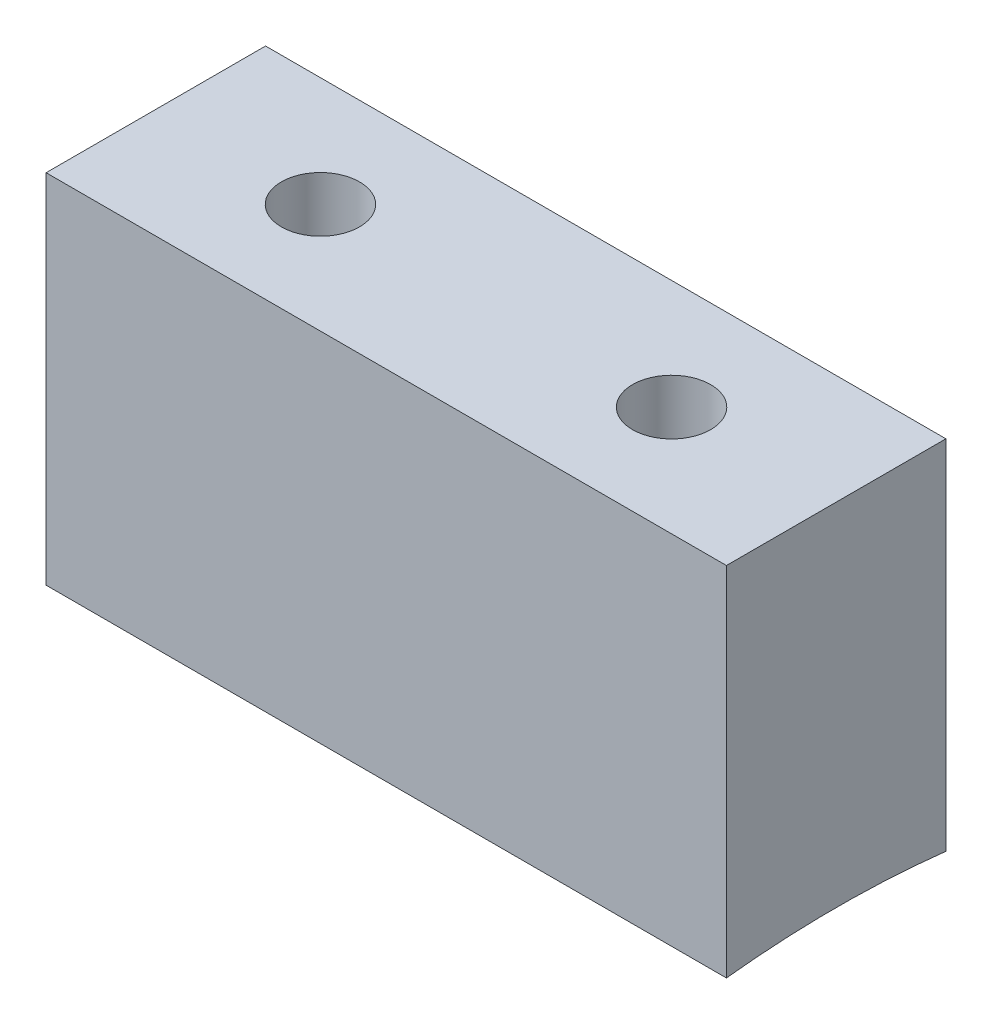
from build123d import *

# Parameters (mm, degrees)
EXTRUDE2_DEPTH        = 3.175
EXTRUDE2_DEPTH_BACK   = 3.175
SKETCH1_W             = 19.685
SKETCH1_H             = 15.545712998
SKETCH2_R             = 28.575
CUT_EXTRUDE1_DEPTH    = 23.378431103
F_4_40_TAPPED_HOLE1_D = 2.2606


with BuildPart() as part:
    # Sketch1 → Extrude2 (new, two sides: drawn at the far end of the back side and taken through both)
    with BuildSketch(Plane.XY.offset(-EXTRUDE2_DEPTH_BACK)):
        with Locations((9.94866666, 2.386588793)):
            Rectangle(SKETCH1_W, SKETCH1_H)
    extrude(amount=EXTRUDE2_DEPTH + EXTRUDE2_DEPTH_BACK)

    # Sketch2 → Cut-Extrude1 (cut, through all)
    with BuildSketch(Plane.ZY.offset(-0.10616666)):
        with Locations((0, -28.575)):
            Circle(SKETCH2_R)
    extrude(amount=-CUT_EXTRUDE1_DEPTH, mode=Mode.SUBTRACT)

    # 4-40 Tapped Hole1 (through all)
    with Locations(Plane(origin=(15.02866666, 10.159445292, 0), x_dir=(1, 0, 0), z_dir=(0, 1, 0))):
        with Locations((0, 0), (-10.16, 0)):
            Hole(F_4_40_TAPPED_HOLE1_D / 2)


solid = part.part
